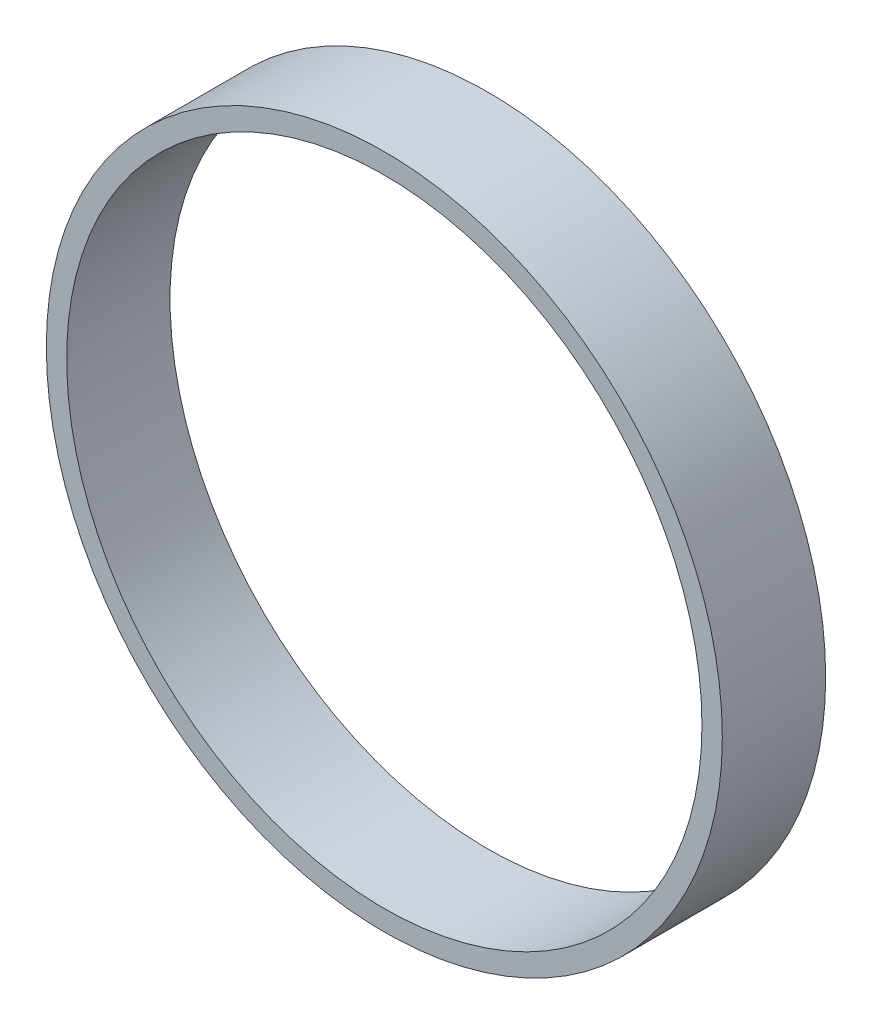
from build123d import *

# Parameters (mm, degrees)
SKETCH1_R      = 83.05
SKETCH1_R_2    = 78.05
BASEPIPE_DEPTH = 12.7


with BuildPart() as part:
    # Sketch1 → BasePipe (new, symmetric)
    with BuildSketch(Plane.XY):
        Circle(SKETCH1_R)
        Circle(SKETCH1_R_2, mode=Mode.SUBTRACT)
    extrude(amount=BASEPIPE_DEPTH, both=True)


solid = part.part
